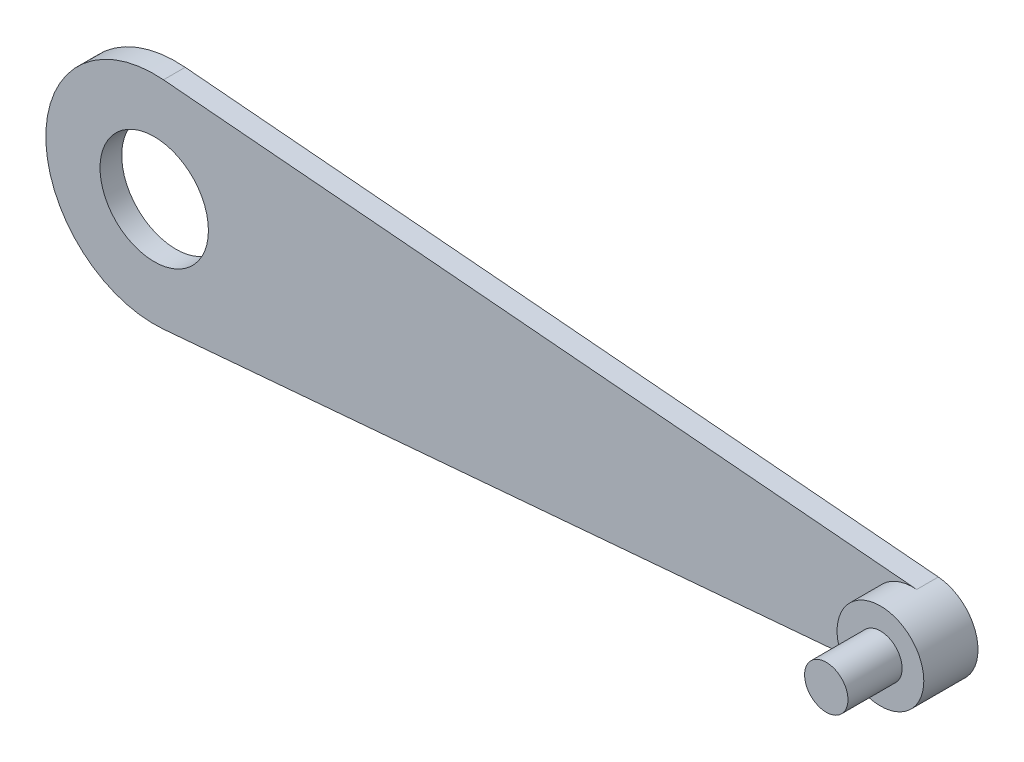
from build123d import *

# Parameters (mm, degrees)
SKETCH1_R      = 5
SKETCH1_R_2    = 2.5
EXTRUDE1_DEPTH = 1
SKETCH2_R      = 2
EXTRUDE2_DEPTH = 2.5
SKETCH3_R      = 1
EXTRUDE3_DEPTH = 2.5
EXTRUDE4_DEPTH = 1


with BuildPart() as part:
    # Sketch1 → Extrude1 (new body)
    with BuildSketch(Plane.XY):
        Circle(SKETCH1_R)
        Circle(SKETCH1_R_2, mode=Mode.SUBTRACT)
    extrude(amount=EXTRUDE1_DEPTH)



with BuildPart() as body_2:
    # Sketch2 → Extrude2 (new body)
    with BuildSketch(Plane.XY):
        with Locations((35, 0)):
            Circle(SKETCH2_R)
    extrude(amount=EXTRUDE2_DEPTH)

    # Sketch3 → Extrude3 (add)
    with BuildSketch(Plane.XY.offset(2.5)):
        with Locations((35, 0)):
            Circle(SKETCH3_R)
    extrude(amount=EXTRUDE3_DEPTH)


with BuildPart() as part_1:
    add(part.part)

    add(body_2.part)  # Extrude4 merges body 2
    # Sketch4 → Extrude4 (add)
    with BuildSketch(Plane.XY):
        with BuildLine():
            Line((0.428571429, 4.981598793), (35.171428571, 1.992639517))
            ThreePointArc((35.171428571, 1.992639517), (33, 0), (35.171428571, -1.992639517))
            Line((35.171428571, -1.992639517), (0.428571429, -4.981598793))
            ThreePointArc((0.428571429, -4.981598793), (5, 0), (0.428571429, 4.981598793))
        make_face()
    extrude(amount=EXTRUDE4_DEPTH)


solid = part_1.part
